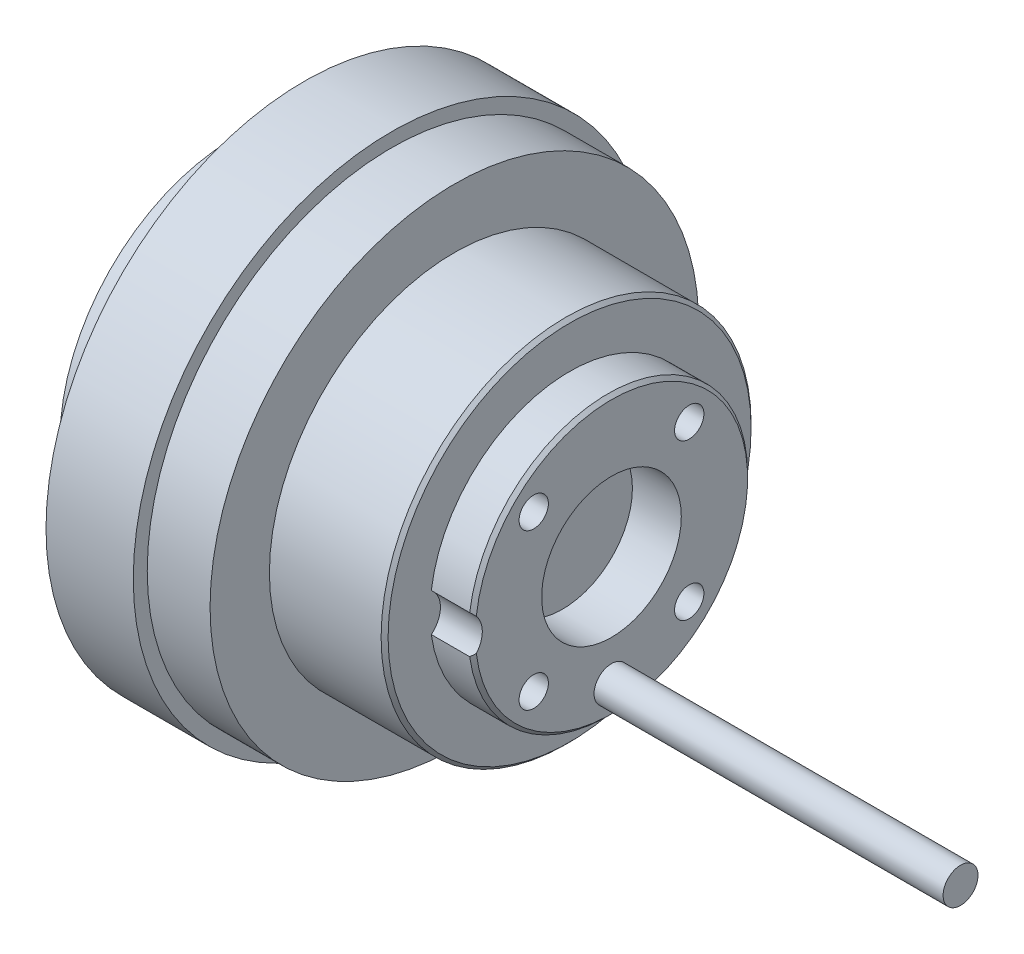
from build123d import *

# Parameters (mm, degrees)
SKETCH2_R                 = 38
BASE_EXTRUDE_DEPTH        = 40
BOSS_EXTRUDE1_DEPTH       = 34
FILLET7_R                 = 2
FILLET9_R                 = 4
F_5_X_45DEG_SIZE          = 0.5
SKETCH5_R                 = 10
F_20MM_DIA_X_7MM_DP_DEPTH = 7
SKETCH6_R                 = 2.5
F_5MM_DIA_X_7MM_DP_DEPTH  = 7
M5X0_8_TAPPED_HOLE1_D     = 4.2
M5X0_8_TAPPED_HOLE1_DEPTH = 11.4
M5X0_8_TAPPED_HOLE1_TIP   = 1.2618073
CUT_EXTRUDE3_START        = -6
CUT_EXTRUDE3_DEPTH        = 6
SKETCH10_W                = 86.944575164
SKETCH10_H                = 113.859346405
CUTOFF_DEPTH              = 139.408814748
EXTRUDE1_DEPTH            = 50
EXTRUDE1_DEPTH_BACK       = 10
SKETCH11_R                = 2.5
SKETCH12_R                = 25
EXTRUDE2_DEPTH            = 10


with BuildPart() as part:
    # Sketch2 → Base-Extrude (new, symmetric)
    with BuildSketch(Plane.XY):
        Circle(SKETCH2_R)
    extrude(amount=BASE_EXTRUDE_DEPTH, both=True)

    # Sketch3 → Boss-Extrude1 (add, symmetric)
    with BuildSketch(Plane.XY):
        with BuildLine():
            Line((46, 40), (46, -40))
            Line((46, -40), (39, -40))
            Line((39, -40), (0, -54))
            Line((0, -54), (-57, -54))
            ThreePointArc((-57, -54), (-59.5, -53.330127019), (-61.330127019, -51.5))
            Line((-61.330127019, -51.5), (-74.330127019, -28.983339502))
            ThreePointArc((-74.330127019, -28.983339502), (-74.829629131, -27.777434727), (-75, -26.483339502))
            Line((-75, -26.483339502), (-75, 16.483339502))
            ThreePointArc((-75, 16.483339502), (-74.829629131, 17.777434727), (-74.330127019, 18.983339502))
            Line((-74.330127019, 18.983339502), (-61.330127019, 41.5))
            ThreePointArc((-61.330127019, 41.5), (-59.5, 43.330127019), (-57, 44))
            Line((-57, 44), (0, 44))
            Line((0, 44), (39, 40))
            Line((39, 40), (46, 40))
        make_face()
    extrude(amount=BOSS_EXTRUDE1_DEPTH, both=True)

    # Fillet7
    fillet7_edges = [part.edges().sort_by_distance(p)[0] for p in [
        (-38, 0, 34),
        (-38, 0, -34),
    ]]
    fillet(fillet7_edges, radius=FILLET7_R)

    # Fillet9
    fillet9_edges = [part.edges().sort_by_distance(p)[0] for p in [
        (42.5, 40, -34),
        (42.5, -40, -34),
        (19.5, 42, -34),
        (19.5, -47, -34),
        (-28.5, 44, -34),
        (-28.5, -54, -34),
        (-59.5, 43.330127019, -34),
        (-59.5, -53.330127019, -34),
        (-67.830127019, 30.241669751, -34),
        (-67.830127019, -40.241669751, -34),
        (-74.829629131, 17.777434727, -34),
        (-74.829629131, -27.777434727, -34),
        (-75, -5, -34),
        (42.5, 40, 34),
        (42.5, -40, 34),
        (19.5, 42, 34),
        (19.5, -47, 34),
        (-28.5, 44, 34),
        (-28.5, -54, 34),
        (-59.5, 43.330127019, 34),
        (-59.5, -53.330127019, 34),
        (-67.830127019, 30.241669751, 34),
        (-67.830127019, -40.241669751, 34),
        (-74.829629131, 17.777434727, 34),
        (-74.829629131, -27.777434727, 34),
        (-75, -5, 34),
    ]]
    fillet(fillet9_edges, radius=FILLET9_R)

    # Sketch4 → Boss-Revolve1 (revolve)
    with BuildSketch(Plane(origin=(0, 0, 0), x_dir=(1, 0, 0), z_dir=(0, 1, 0))):
        Polygon((40, -34), (40, 0), (90, 0), (90, -20), (84, -20), (84, -26.5), (67.5, -26.5), (67.5, -35), (58.5, -35), (58.5, -37), (46, -37), align=None)
    revolve(axis=Axis((0, 0, 0), (1, 0, 0)))

    # 5 x 45deg
    f_5_x_45deg_edges = [part.edges().sort_by_distance(p)[0] for p in [
        (90, 0, -20),
        (84, 0, -26.5),
    ]]
    chamfer(f_5_x_45deg_edges, length=F_5_X_45DEG_SIZE)

    # Sketch5 → 20mm dia x 7mm dp (cut)
    with BuildSketch(Plane(origin=(90, 0, 0), x_dir=(0, 0, -1), z_dir=(1, 0, 0))):
        Circle(SKETCH5_R)
    extrude(amount=-F_20MM_DIA_X_7MM_DP_DEPTH, mode=Mode.SUBTRACT)

    # Sketch6 → 5mm dia x 7mm dp (cut)
    with BuildSketch(Plane(origin=(90, 0, 0), x_dir=(0, 0, -1), z_dir=(1, 0, 0))):
        with Locations((0, -15.75)):
            Circle(SKETCH6_R)
    extrude(amount=-F_5MM_DIA_X_7MM_DP_DEPTH, mode=Mode.SUBTRACT)

    # M5x0.8 Tapped Hole1
    with Locations(Plane(origin=(90, 0, 0), x_dir=(0, 0, -1), z_dir=(1, 0, 0))):
        with Locations((-11.136931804, 11.136931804), (-11.136931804, -11.136931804), (11.136931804, -11.136931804), (11.136931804, 11.136931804)):
            Hole(M5X0_8_TAPPED_HOLE1_D / 2, depth=M5X0_8_TAPPED_HOLE1_DEPTH)
            with Locations((0, 0, -(M5X0_8_TAPPED_HOLE1_DEPTH + M5X0_8_TAPPED_HOLE1_TIP / 2))):  # 118° drill point
                Cone(0, M5X0_8_TAPPED_HOLE1_D / 2, M5X0_8_TAPPED_HOLE1_TIP, mode=Mode.SUBTRACT)

    # Sketch9 → Cut-Extrude3 (cut)
    with BuildSketch(Plane(origin=(90, 0, 0), x_dir=(0, 0, -1), z_dir=(1, 0, 0)).offset(CUT_EXTRUDE3_START)):
        with BuildLine():
            ThreePointArc((-19.8125, -2.732186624), (-18.5, 0), (-19.8125, 2.732186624))
            ThreePointArc((-19.8125, 2.732186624), (-20, 0), (-19.8125, -2.732186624))
        make_face()
    extrude(amount=CUT_EXTRUDE3_DEPTH, mode=Mode.SUBTRACT)

    # Sketch10 → cutoff (cut, through all)
    with BuildSketch(Plane(origin=(46, 0, 0), x_dir=(0, 0, -1), z_dir=(1, 0, 0))):
        with Locations((-1.056862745, -5.281830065)):
            Rectangle(SKETCH10_W, SKETCH10_H)
    extrude(amount=-CUTOFF_DEPTH, mode=Mode.SUBTRACT)

    # Sketch11 → Extrude1 (add, two sides: drawn at the far end of the back side and taken through both)
    with BuildSketch(Plane(origin=(90, 0, 0), x_dir=(0, 0, -1), z_dir=(1, 0, 0)).offset(-EXTRUDE1_DEPTH_BACK)):
        with Locations((0, -15.75)):
            Circle(SKETCH11_R)
    extrude(amount=EXTRUDE1_DEPTH + EXTRUDE1_DEPTH_BACK)

    # Sketch12 → Extrude2 (add)
    with BuildSketch(Plane.ZY.offset(-46)):
        Circle(SKETCH12_R)
    extrude(amount=EXTRUDE2_DEPTH)


solid = part.part
